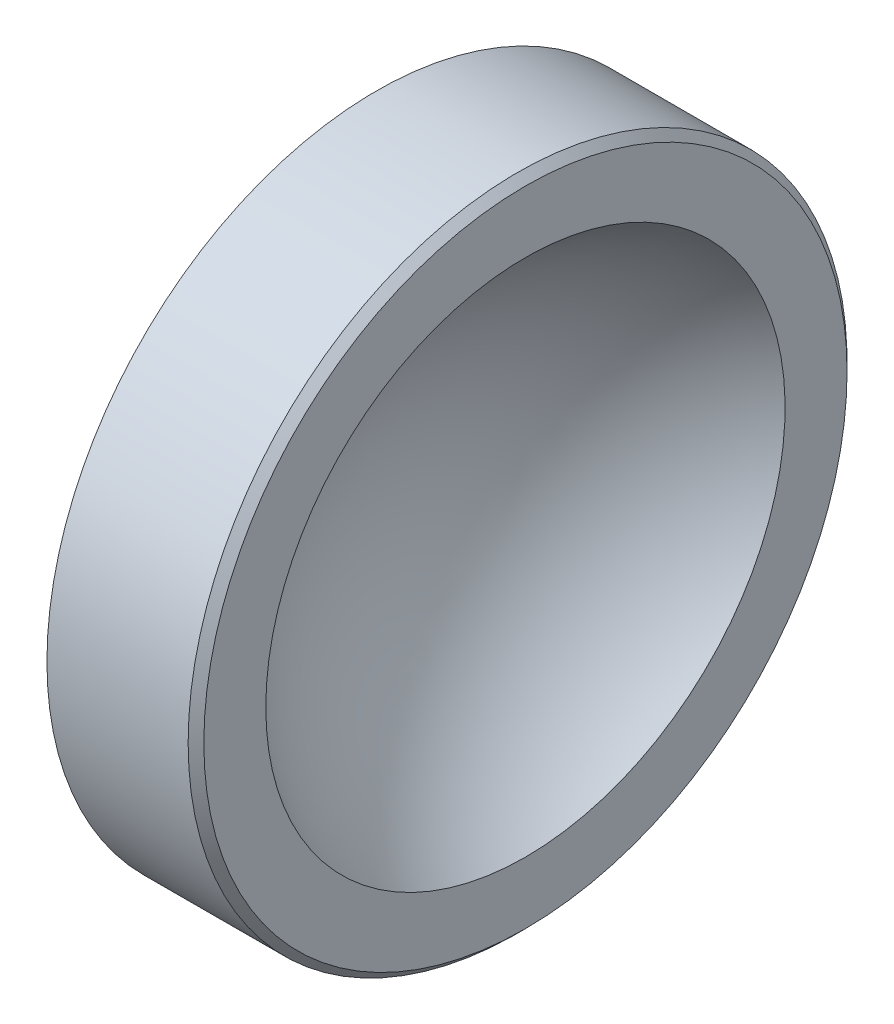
ISO-10303-21;
HEADER;
FILE_DESCRIPTION(('STEP AP214'),'2;1');
FILE_NAME('part.step','',(''),(''),'','','');
FILE_SCHEMA(('AUTOMOTIVE_DESIGN { 1 0 10303 214 1 1 1 1 }'));
ENDSEC;
DATA;
#1=APPLICATION_CONTEXT('core data for automotive mechanical design processes');
#2=APPLICATION_PROTOCOL_DEFINITION('international standard','automotive_design',2000,#1);
#3=PRODUCT_CONTEXT('',#1,'mechanical');
#4=PRODUCT('Part','Part','',(#3));
#5=PRODUCT_RELATED_PRODUCT_CATEGORY('part','',(#4));
#6=PRODUCT_DEFINITION_FORMATION('','',#4);
#7=PRODUCT_DEFINITION_CONTEXT('part definition',#1,'design');
#8=PRODUCT_DEFINITION('design','',#6,#7);
#9=PRODUCT_DEFINITION_SHAPE('','',#8);
#10=(LENGTH_UNIT() NAMED_UNIT(*) SI_UNIT(.MILLI.,.METRE.));
#11=(NAMED_UNIT(*) PLANE_ANGLE_UNIT() SI_UNIT($,.RADIAN.));
#12=(NAMED_UNIT(*) SI_UNIT($,.STERADIAN.) SOLID_ANGLE_UNIT());
#13=UNCERTAINTY_MEASURE_WITH_UNIT(LENGTH_MEASURE(1.E-05),#10,'distance_accuracy_value','');
#14=(GEOMETRIC_REPRESENTATION_CONTEXT(3) GLOBAL_UNCERTAINTY_ASSIGNED_CONTEXT((#13)) GLOBAL_UNIT_ASSIGNED_CONTEXT((#10,
#11,#12)) REPRESENTATION_CONTEXT('',''));
#15=CARTESIAN_POINT('',(0.,0.,0.));
#16=DIRECTION('',(0.,0.,1.));
#17=DIRECTION('',(1.,0.,0.));
#18=AXIS2_PLACEMENT_3D('',#15,#16,#17);
#19=CARTESIAN_POINT('',(110.000000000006,0.,0.));
#20=DIRECTION('',(-1.,0.,0.));
#21=DIRECTION('',(0.,-1.,0.));
#22=AXIS2_PLACEMENT_3D('',#19,#20,#21);
#23=SPHERICAL_SURFACE('',#22,110.500000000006);
#24=CARTESIAN_POINT('',(0.,0.,0.));
#25=DIRECTION('',(-1.,0.,0.));
#26=DIRECTION('',(0.,0.,1.));
#27=AXIS2_PLACEMENT_3D('',#24,#25,#26);
#28=CIRCLE('',#27,10.5);
#29=CARTESIAN_POINT('',(0.,0.,10.5));
#30=VERTEX_POINT('',#29);
#31=EDGE_CURVE('E54',#30,#30,#28,.T.);
#32=ORIENTED_EDGE('',*,*,#31,.T.);
#33=EDGE_LOOP('',(#32));
#34=FACE_BOUND('',#33,.T.);
#35=ADVANCED_FACE('F40',(#34),#23,.T.);
#36=CARTESIAN_POINT('',(-2.58927786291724,0.,0.));
#37=DIRECTION('',(-1.,0.,0.));
#38=DIRECTION('',(0.,0.,1.));
#39=AXIS2_PLACEMENT_3D('',#36,#37,#38);
#40=CYLINDRICAL_SURFACE('',#39,10.5);
#41=CARTESIAN_POINT('',(4.5,0.,0.));
#42=DIRECTION('',(-1.,0.,0.));
#43=DIRECTION('',(0.,0.,1.));
#44=AXIS2_PLACEMENT_3D('',#41,#42,#43);
#45=CIRCLE('',#44,10.5);
#46=CARTESIAN_POINT('',(4.5,0.,10.5));
#47=VERTEX_POINT('',#46);
#48=EDGE_CURVE('E49',#47,#47,#45,.T.);
#49=ORIENTED_EDGE('',*,*,#48,.T.);
#50=EDGE_LOOP('',(#49));
#51=FACE_BOUND('',#50,.T.);
#52=ORIENTED_EDGE('',*,*,#31,.F.);
#53=EDGE_LOOP('',(#52));
#54=FACE_BOUND('',#53,.T.);
#55=ADVANCED_FACE('F77',(#51,#54),#40,.T.);
#56=CARTESIAN_POINT('',(4.75,0.,0.));
#57=DIRECTION('',(-1.,0.,0.));
#58=DIRECTION('',(0.,0.,1.));
#59=AXIS2_PLACEMENT_3D('',#56,#57,#58);
#60=PLANE('',#59);
#61=CARTESIAN_POINT('',(4.75,0.,0.));
#62=DIRECTION('',(-1.,0.,0.));
#63=DIRECTION('',(0.,0.,1.));
#64=AXIS2_PLACEMENT_3D('',#61,#62,#63);
#65=CIRCLE('',#64,10.25);
#66=CARTESIAN_POINT('',(4.75,0.,10.25));
#67=VERTEX_POINT('',#66);
#68=EDGE_CURVE('E10',#67,#67,#65,.F.);
#69=ORIENTED_EDGE('',*,*,#68,.T.);
#70=EDGE_LOOP('',(#69));
#71=FACE_BOUND('',#70,.T.);
#72=CARTESIAN_POINT('',(4.75,0.,0.));
#73=DIRECTION('',(-1.,0.,0.));
#74=DIRECTION('',(0.,0.,1.));
#75=AXIS2_PLACEMENT_3D('',#72,#73,#74);
#76=CIRCLE('',#75,8.275);
#77=CARTESIAN_POINT('',(4.75,0.,8.275));
#78=VERTEX_POINT('',#77);
#79=EDGE_CURVE('E59',#78,#78,#76,.T.);
#80=ORIENTED_EDGE('',*,*,#79,.T.);
#81=EDGE_LOOP('',(#80));
#82=FACE_BOUND('',#81,.T.);
#83=ADVANCED_FACE('F66',(#71,#82),#60,.F.);
#84=CARTESIAN_POINT('',(9.89298569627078,0.,0.));
#85=DIRECTION('',(-1.,0.,0.));
#86=DIRECTION('',(0.,-1.,0.));
#87=AXIS2_PLACEMENT_3D('',#84,#85,#86);
#88=SPHERICAL_SURFACE('',#87,9.74299373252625);
#89=ORIENTED_EDGE('',*,*,#79,.F.);
#90=EDGE_LOOP('',(#89));
#91=FACE_BOUND('',#90,.T.);
#92=ADVANCED_FACE('F68',(#91),#88,.F.);
#93=CARTESIAN_POINT('',(4.5,0.,0.));
#94=DIRECTION('',(-1.,0.,0.));
#95=DIRECTION('',(0.,0.,1.));
#96=AXIS2_PLACEMENT_3D('',#93,#94,#95);
#97=CONICAL_SURFACE('',#96,10.5,0.785398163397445);
#98=ORIENTED_EDGE('',*,*,#68,.F.);
#99=EDGE_LOOP('',(#98));
#100=FACE_BOUND('',#99,.T.);
#101=ORIENTED_EDGE('',*,*,#48,.F.);
#102=EDGE_LOOP('',(#101));
#103=FACE_BOUND('',#102,.T.);
#104=ADVANCED_FACE('F43',(#100,#103),#97,.T.);
#105=CLOSED_SHELL('',(#35,#55,#83,#92,#104));
#106=MANIFOLD_SOLID_BREP('B2',#105);
#107=ADVANCED_BREP_SHAPE_REPRESENTATION('',(#18,#106),#14);
#108=SHAPE_DEFINITION_REPRESENTATION(#9,#107);
ENDSEC;
END-ISO-10303-21;
